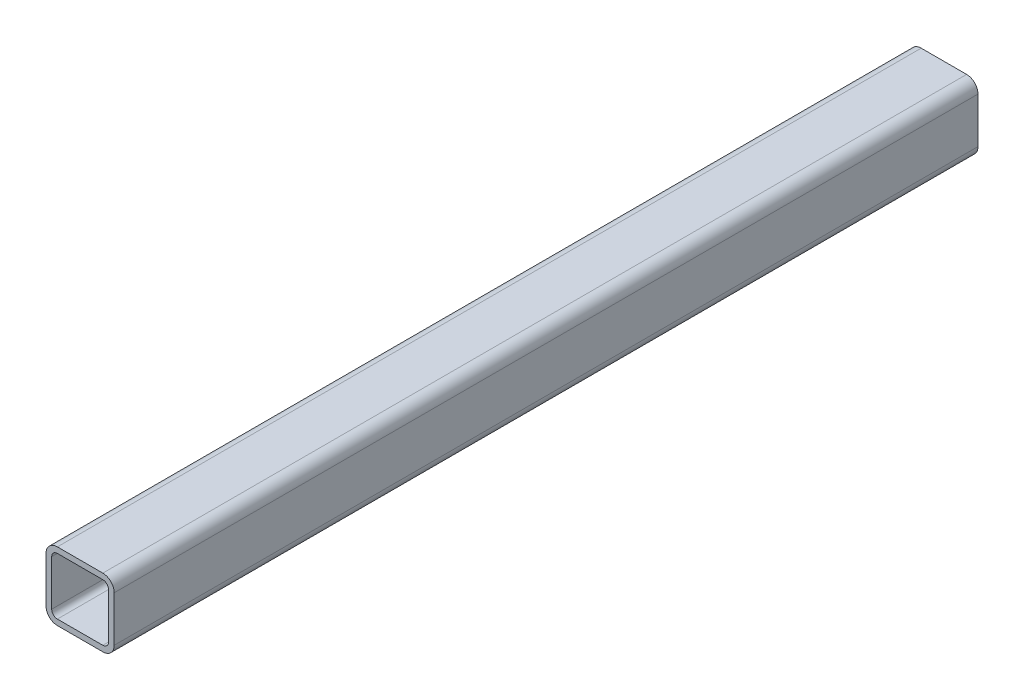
ISO-10303-21;
HEADER;
FILE_DESCRIPTION(('STEP AP214'),'2;1');
FILE_NAME('part.step','',(''),(''),'','','');
FILE_SCHEMA(('AUTOMOTIVE_DESIGN { 1 0 10303 214 1 1 1 1 }'));
ENDSEC;
DATA;
#1=APPLICATION_CONTEXT('core data for automotive mechanical design processes');
#2=APPLICATION_PROTOCOL_DEFINITION('international standard','automotive_design',2000,#1);
#3=PRODUCT_CONTEXT('',#1,'mechanical');
#4=PRODUCT('Part','Part','',(#3));
#5=PRODUCT_RELATED_PRODUCT_CATEGORY('part','',(#4));
#6=PRODUCT_DEFINITION_FORMATION('','',#4);
#7=PRODUCT_DEFINITION_CONTEXT('part definition',#1,'design');
#8=PRODUCT_DEFINITION('design','',#6,#7);
#9=PRODUCT_DEFINITION_SHAPE('','',#8);
#10=(LENGTH_UNIT() NAMED_UNIT(*) SI_UNIT(.MILLI.,.METRE.));
#11=(NAMED_UNIT(*) PLANE_ANGLE_UNIT() SI_UNIT($,.RADIAN.));
#12=(NAMED_UNIT(*) SI_UNIT($,.STERADIAN.) SOLID_ANGLE_UNIT());
#13=UNCERTAINTY_MEASURE_WITH_UNIT(LENGTH_MEASURE(1.E-05),#10,'distance_accuracy_value','');
#14=(GEOMETRIC_REPRESENTATION_CONTEXT(3) GLOBAL_UNCERTAINTY_ASSIGNED_CONTEXT((#13)) GLOBAL_UNIT_ASSIGNED_CONTEXT((#10,
#11,#12)) REPRESENTATION_CONTEXT('',''));
#15=CARTESIAN_POINT('',(0.,0.,0.));
#16=DIRECTION('',(0.,0.,1.));
#17=DIRECTION('',(1.,0.,0.));
#18=AXIS2_PLACEMENT_3D('',#15,#16,#17);
#19=CARTESIAN_POINT('',(20.,20.,760.));
#20=DIRECTION('',(0.,0.,1.));
#21=DIRECTION('',(1.,0.,0.));
#22=AXIS2_PLACEMENT_3D('',#19,#20,#21);
#23=PLANE('',#22);
#24=CARTESIAN_POINT('',(20.,20.,760.));
#25=DIRECTION('',(0.,0.,1.));
#26=DIRECTION('',(1.,0.,0.));
#27=AXIS2_PLACEMENT_3D('',#24,#25,#26);
#28=CIRCLE('',#27,10.);
#29=CARTESIAN_POINT('',(30.,20.,760.));
#30=VERTEX_POINT('',#29);
#31=CARTESIAN_POINT('',(20.,30.,760.));
#32=VERTEX_POINT('',#31);
#33=EDGE_CURVE('E210',#30,#32,#28,.T.);
#34=ORIENTED_EDGE('',*,*,#33,.T.);
#35=DIRECTION('',(-1.,0.,0.));
#36=VECTOR('',#35,1.);
#37=CARTESIAN_POINT('',(20.,30.,760.));
#38=LINE('',#37,#36);
#39=CARTESIAN_POINT('',(-20.,30.,760.));
#40=VERTEX_POINT('',#39);
#41=EDGE_CURVE('E213',#32,#40,#38,.T.);
#42=ORIENTED_EDGE('',*,*,#41,.T.);
#43=CARTESIAN_POINT('',(-20.,20.,760.));
#44=DIRECTION('',(0.,0.,1.));
#45=DIRECTION('',(1.,0.,0.));
#46=AXIS2_PLACEMENT_3D('',#43,#44,#45);
#47=CIRCLE('',#46,10.);
#48=CARTESIAN_POINT('',(-30.,20.,760.));
#49=VERTEX_POINT('',#48);
#50=EDGE_CURVE('E216',#40,#49,#47,.T.);
#51=ORIENTED_EDGE('',*,*,#50,.T.);
#52=DIRECTION('',(0.,-1.,0.));
#53=VECTOR('',#52,1.);
#54=CARTESIAN_POINT('',(-30.,-20.,760.));
#55=LINE('',#54,#53);
#56=CARTESIAN_POINT('',(-30.,-20.,760.));
#57=VERTEX_POINT('',#56);
#58=EDGE_CURVE('E218',#49,#57,#55,.T.);
#59=ORIENTED_EDGE('',*,*,#58,.T.);
#60=CARTESIAN_POINT('',(-20.,-20.,760.));
#61=DIRECTION('',(0.,0.,1.));
#62=DIRECTION('',(1.,0.,0.));
#63=AXIS2_PLACEMENT_3D('',#60,#61,#62);
#64=CIRCLE('',#63,10.);
#65=CARTESIAN_POINT('',(-20.,-30.,760.));
#66=VERTEX_POINT('',#65);
#67=EDGE_CURVE('E220',#57,#66,#64,.T.);
#68=ORIENTED_EDGE('',*,*,#67,.T.);
#69=DIRECTION('',(1.,0.,0.));
#70=VECTOR('',#69,1.);
#71=CARTESIAN_POINT('',(-20.,-30.,760.));
#72=LINE('',#71,#70);
#73=CARTESIAN_POINT('',(20.,-30.,760.));
#74=VERTEX_POINT('',#73);
#75=EDGE_CURVE('E222',#66,#74,#72,.T.);
#76=ORIENTED_EDGE('',*,*,#75,.T.);
#77=CARTESIAN_POINT('',(20.,-20.,760.));
#78=DIRECTION('',(0.,0.,1.));
#79=DIRECTION('',(1.,0.,0.));
#80=AXIS2_PLACEMENT_3D('',#77,#78,#79);
#81=CIRCLE('',#80,10.);
#82=CARTESIAN_POINT('',(30.,-20.,760.));
#83=VERTEX_POINT('',#82);
#84=EDGE_CURVE('E224',#74,#83,#81,.T.);
#85=ORIENTED_EDGE('',*,*,#84,.T.);
#86=DIRECTION('',(0.,1.,0.));
#87=VECTOR('',#86,1.);
#88=CARTESIAN_POINT('',(30.,20.,760.));
#89=LINE('',#88,#87);
#90=EDGE_CURVE('E226',#83,#30,#89,.T.);
#91=ORIENTED_EDGE('',*,*,#90,.T.);
#92=EDGE_LOOP('',(#34,#42,#51,#59,#68,#76,#85,#91));
#93=FACE_BOUND('',#92,.T.);
#94=DIRECTION('',(0.,-1.,0.));
#95=VECTOR('',#94,1.);
#96=CARTESIAN_POINT('',(-25.,-20.,760.));
#97=LINE('',#96,#95);
#98=CARTESIAN_POINT('',(-25.,20.,760.));
#99=VERTEX_POINT('',#98);
#100=CARTESIAN_POINT('',(-25.,-20.,760.));
#101=VERTEX_POINT('',#100);
#102=EDGE_CURVE('E153',#99,#101,#97,.T.);
#103=ORIENTED_EDGE('',*,*,#102,.F.);
#104=CARTESIAN_POINT('',(-20.,20.,760.));
#105=DIRECTION('',(0.,0.,1.));
#106=DIRECTION('',(1.,0.,0.));
#107=AXIS2_PLACEMENT_3D('',#104,#105,#106);
#108=CIRCLE('',#107,5.00000000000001);
#109=CARTESIAN_POINT('',(-20.,25.,760.));
#110=VERTEX_POINT('',#109);
#111=EDGE_CURVE('E145',#110,#99,#108,.T.);
#112=ORIENTED_EDGE('',*,*,#111,.F.);
#113=DIRECTION('',(-1.,0.,0.));
#114=VECTOR('',#113,1.);
#115=CARTESIAN_POINT('',(20.,25.,760.));
#116=LINE('',#115,#114);
#117=CARTESIAN_POINT('',(20.,25.,760.));
#118=VERTEX_POINT('',#117);
#119=EDGE_CURVE('E178',#118,#110,#116,.T.);
#120=ORIENTED_EDGE('',*,*,#119,.F.);
#121=CARTESIAN_POINT('',(20.,20.,760.));
#122=DIRECTION('',(0.,0.,1.));
#123=DIRECTION('',(1.,0.,0.));
#124=AXIS2_PLACEMENT_3D('',#121,#122,#123);
#125=CIRCLE('',#124,5.00000000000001);
#126=CARTESIAN_POINT('',(25.,20.,760.));
#127=VERTEX_POINT('',#126);
#128=EDGE_CURVE('E176',#127,#118,#125,.T.);
#129=ORIENTED_EDGE('',*,*,#128,.F.);
#130=DIRECTION('',(0.,1.,0.));
#131=VECTOR('',#130,1.);
#132=CARTESIAN_POINT('',(25.,20.,760.));
#133=LINE('',#132,#131);
#134=CARTESIAN_POINT('',(25.,-20.,760.));
#135=VERTEX_POINT('',#134);
#136=EDGE_CURVE('E174',#135,#127,#133,.T.);
#137=ORIENTED_EDGE('',*,*,#136,.F.);
#138=CARTESIAN_POINT('',(20.,-20.,760.));
#139=DIRECTION('',(0.,0.,1.));
#140=DIRECTION('',(1.,0.,0.));
#141=AXIS2_PLACEMENT_3D('',#138,#139,#140);
#142=CIRCLE('',#141,5.00000000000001);
#143=CARTESIAN_POINT('',(20.,-25.,760.));
#144=VERTEX_POINT('',#143);
#145=EDGE_CURVE('E172',#144,#135,#142,.T.);
#146=ORIENTED_EDGE('',*,*,#145,.F.);
#147=DIRECTION('',(1.,0.,0.));
#148=VECTOR('',#147,1.);
#149=CARTESIAN_POINT('',(-20.,-25.,760.));
#150=LINE('',#149,#148);
#151=CARTESIAN_POINT('',(-20.,-25.,760.));
#152=VERTEX_POINT('',#151);
#153=EDGE_CURVE('E168',#152,#144,#150,.T.);
#154=ORIENTED_EDGE('',*,*,#153,.F.);
#155=CARTESIAN_POINT('',(-20.,-20.,760.));
#156=DIRECTION('',(0.,0.,1.));
#157=DIRECTION('',(1.,0.,0.));
#158=AXIS2_PLACEMENT_3D('',#155,#156,#157);
#159=CIRCLE('',#158,5.);
#160=EDGE_CURVE('E166',#101,#152,#159,.T.);
#161=ORIENTED_EDGE('',*,*,#160,.F.);
#162=EDGE_LOOP('',(#103,#112,#120,#129,#137,#146,#154,#161));
#163=FACE_BOUND('',#162,.T.);
#164=ADVANCED_FACE('F32',(#93,#163),#23,.T.);
#165=CARTESIAN_POINT('',(20.,20.,0.));
#166=DIRECTION('',(0.,0.,1.));
#167=DIRECTION('',(1.,0.,0.));
#168=AXIS2_PLACEMENT_3D('',#165,#166,#167);
#169=PLANE('',#168);
#170=CARTESIAN_POINT('',(20.,20.,0.));
#171=DIRECTION('',(0.,0.,1.));
#172=DIRECTION('',(1.,0.,0.));
#173=AXIS2_PLACEMENT_3D('',#170,#171,#172);
#174=CIRCLE('',#173,10.);
#175=CARTESIAN_POINT('',(30.,20.,0.));
#176=VERTEX_POINT('',#175);
#177=CARTESIAN_POINT('',(20.,30.,0.));
#178=VERTEX_POINT('',#177);
#179=EDGE_CURVE('E161',#176,#178,#174,.T.);
#180=ORIENTED_EDGE('',*,*,#179,.F.);
#181=DIRECTION('',(0.,1.,0.));
#182=VECTOR('',#181,1.);
#183=CARTESIAN_POINT('',(30.,20.,0.));
#184=LINE('',#183,#182);
#185=CARTESIAN_POINT('',(30.,-20.,0.));
#186=VERTEX_POINT('',#185);
#187=EDGE_CURVE('E214',#186,#176,#184,.T.);
#188=ORIENTED_EDGE('',*,*,#187,.F.);
#189=CARTESIAN_POINT('',(20.,-20.,0.));
#190=DIRECTION('',(0.,0.,1.));
#191=DIRECTION('',(1.,0.,0.));
#192=AXIS2_PLACEMENT_3D('',#189,#190,#191);
#193=CIRCLE('',#192,10.);
#194=CARTESIAN_POINT('',(20.,-30.,0.));
#195=VERTEX_POINT('',#194);
#196=EDGE_CURVE('E241',#195,#186,#193,.T.);
#197=ORIENTED_EDGE('',*,*,#196,.F.);
#198=DIRECTION('',(1.,0.,0.));
#199=VECTOR('',#198,1.);
#200=CARTESIAN_POINT('',(-20.,-30.,0.));
#201=LINE('',#200,#199);
#202=CARTESIAN_POINT('',(-20.,-30.,0.));
#203=VERTEX_POINT('',#202);
#204=EDGE_CURVE('E239',#203,#195,#201,.T.);
#205=ORIENTED_EDGE('',*,*,#204,.F.);
#206=CARTESIAN_POINT('',(-20.,-20.,0.));
#207=DIRECTION('',(0.,0.,1.));
#208=DIRECTION('',(1.,0.,0.));
#209=AXIS2_PLACEMENT_3D('',#206,#207,#208);
#210=CIRCLE('',#209,10.);
#211=CARTESIAN_POINT('',(-30.,-20.,0.));
#212=VERTEX_POINT('',#211);
#213=EDGE_CURVE('E237',#212,#203,#210,.T.);
#214=ORIENTED_EDGE('',*,*,#213,.F.);
#215=DIRECTION('',(0.,-1.,0.));
#216=VECTOR('',#215,1.);
#217=CARTESIAN_POINT('',(-30.,-20.,0.));
#218=LINE('',#217,#216);
#219=CARTESIAN_POINT('',(-30.,20.,0.));
#220=VERTEX_POINT('',#219);
#221=EDGE_CURVE('E235',#220,#212,#218,.T.);
#222=ORIENTED_EDGE('',*,*,#221,.F.);
#223=CARTESIAN_POINT('',(-20.,20.,0.));
#224=DIRECTION('',(0.,0.,1.));
#225=DIRECTION('',(1.,0.,0.));
#226=AXIS2_PLACEMENT_3D('',#223,#224,#225);
#227=CIRCLE('',#226,10.);
#228=CARTESIAN_POINT('',(-20.,30.,0.));
#229=VERTEX_POINT('',#228);
#230=EDGE_CURVE('E233',#229,#220,#227,.T.);
#231=ORIENTED_EDGE('',*,*,#230,.F.);
#232=DIRECTION('',(-1.,0.,0.));
#233=VECTOR('',#232,1.);
#234=CARTESIAN_POINT('',(20.,30.,0.));
#235=LINE('',#234,#233);
#236=EDGE_CURVE('E231',#178,#229,#235,.T.);
#237=ORIENTED_EDGE('',*,*,#236,.F.);
#238=EDGE_LOOP('',(#180,#188,#197,#205,#214,#222,#231,#237));
#239=FACE_BOUND('',#238,.T.);
#240=CARTESIAN_POINT('',(-20.,20.,0.));
#241=DIRECTION('',(0.,0.,1.));
#242=DIRECTION('',(1.,0.,0.));
#243=AXIS2_PLACEMENT_3D('',#240,#241,#242);
#244=CIRCLE('',#243,5.00000000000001);
#245=CARTESIAN_POINT('',(-20.,25.,0.));
#246=VERTEX_POINT('',#245);
#247=CARTESIAN_POINT('',(-25.,20.,0.));
#248=VERTEX_POINT('',#247);
#249=EDGE_CURVE('E55',#246,#248,#244,.T.);
#250=ORIENTED_EDGE('',*,*,#249,.T.);
#251=DIRECTION('',(0.,-1.,0.));
#252=VECTOR('',#251,1.);
#253=CARTESIAN_POINT('',(-25.,-20.,0.));
#254=LINE('',#253,#252);
#255=CARTESIAN_POINT('',(-25.,-20.,0.));
#256=VERTEX_POINT('',#255);
#257=EDGE_CURVE('E160',#248,#256,#254,.T.);
#258=ORIENTED_EDGE('',*,*,#257,.T.);
#259=CARTESIAN_POINT('',(-20.,-20.,0.));
#260=DIRECTION('',(0.,0.,1.));
#261=DIRECTION('',(1.,0.,0.));
#262=AXIS2_PLACEMENT_3D('',#259,#260,#261);
#263=CIRCLE('',#262,5.);
#264=CARTESIAN_POINT('',(-20.,-25.,0.));
#265=VERTEX_POINT('',#264);
#266=EDGE_CURVE('E182',#256,#265,#263,.T.);
#267=ORIENTED_EDGE('',*,*,#266,.T.);
#268=DIRECTION('',(1.,0.,0.));
#269=VECTOR('',#268,1.);
#270=CARTESIAN_POINT('',(-20.,-25.,0.));
#271=LINE('',#270,#269);
#272=CARTESIAN_POINT('',(20.,-25.,0.));
#273=VERTEX_POINT('',#272);
#274=EDGE_CURVE('E185',#265,#273,#271,.T.);
#275=ORIENTED_EDGE('',*,*,#274,.T.);
#276=CARTESIAN_POINT('',(20.,-20.,0.));
#277=DIRECTION('',(0.,0.,1.));
#278=DIRECTION('',(1.,0.,0.));
#279=AXIS2_PLACEMENT_3D('',#276,#277,#278);
#280=CIRCLE('',#279,5.00000000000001);
#281=CARTESIAN_POINT('',(25.,-20.,0.));
#282=VERTEX_POINT('',#281);
#283=EDGE_CURVE('E188',#273,#282,#280,.T.);
#284=ORIENTED_EDGE('',*,*,#283,.T.);
#285=DIRECTION('',(0.,1.,0.));
#286=VECTOR('',#285,1.);
#287=CARTESIAN_POINT('',(25.,20.,0.));
#288=LINE('',#287,#286);
#289=CARTESIAN_POINT('',(25.,20.,0.));
#290=VERTEX_POINT('',#289);
#291=EDGE_CURVE('E191',#282,#290,#288,.T.);
#292=ORIENTED_EDGE('',*,*,#291,.T.);
#293=CARTESIAN_POINT('',(20.,20.,0.));
#294=DIRECTION('',(0.,0.,1.));
#295=DIRECTION('',(1.,0.,0.));
#296=AXIS2_PLACEMENT_3D('',#293,#294,#295);
#297=CIRCLE('',#296,5.00000000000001);
#298=CARTESIAN_POINT('',(20.,25.,0.));
#299=VERTEX_POINT('',#298);
#300=EDGE_CURVE('E194',#290,#299,#297,.T.);
#301=ORIENTED_EDGE('',*,*,#300,.T.);
#302=DIRECTION('',(-1.,0.,0.));
#303=VECTOR('',#302,1.);
#304=CARTESIAN_POINT('',(20.,25.,0.));
#305=LINE('',#304,#303);
#306=EDGE_CURVE('E154',#299,#246,#305,.T.);
#307=ORIENTED_EDGE('',*,*,#306,.T.);
#308=EDGE_LOOP('',(#250,#258,#267,#275,#284,#292,#301,#307));
#309=FACE_BOUND('',#308,.T.);
#310=ADVANCED_FACE('F271',(#239,#309),#169,.F.);
#311=CARTESIAN_POINT('',(20.,20.,760.));
#312=DIRECTION('',(0.,0.,-1.));
#313=DIRECTION('',(-1.,0.,0.));
#314=AXIS2_PLACEMENT_3D('',#311,#312,#313);
#315=CYLINDRICAL_SURFACE('',#314,10.);
#316=ORIENTED_EDGE('',*,*,#179,.T.);
#317=DIRECTION('',(0.,0.,-1.));
#318=VECTOR('',#317,1.);
#319=CARTESIAN_POINT('',(20.,30.,760.));
#320=LINE('',#319,#318);
#321=EDGE_CURVE('E11',#32,#178,#320,.T.);
#322=ORIENTED_EDGE('',*,*,#321,.F.);
#323=ORIENTED_EDGE('',*,*,#33,.F.);
#324=DIRECTION('',(0.,0.,-1.));
#325=VECTOR('',#324,1.);
#326=CARTESIAN_POINT('',(30.,20.,760.));
#327=LINE('',#326,#325);
#328=EDGE_CURVE('E228',#30,#176,#327,.T.);
#329=ORIENTED_EDGE('',*,*,#328,.T.);
#330=EDGE_LOOP('',(#316,#322,#323,#329));
#331=FACE_BOUND('',#330,.T.);
#332=ADVANCED_FACE('F34',(#331),#315,.T.);
#333=CARTESIAN_POINT('',(20.,30.,760.));
#334=DIRECTION('',(0.,-1.,0.));
#335=DIRECTION('',(1.,0.,0.));
#336=AXIS2_PLACEMENT_3D('',#333,#334,#335);
#337=PLANE('',#336);
#338=ORIENTED_EDGE('',*,*,#236,.T.);
#339=DIRECTION('',(0.,0.,-1.));
#340=VECTOR('',#339,1.);
#341=CARTESIAN_POINT('',(-20.,30.,760.));
#342=LINE('',#341,#340);
#343=EDGE_CURVE('E40',#40,#229,#342,.T.);
#344=ORIENTED_EDGE('',*,*,#343,.F.);
#345=ORIENTED_EDGE('',*,*,#41,.F.);
#346=ORIENTED_EDGE('',*,*,#321,.T.);
#347=EDGE_LOOP('',(#338,#344,#345,#346));
#348=FACE_BOUND('',#347,.T.);
#349=ADVANCED_FACE('F288',(#348),#337,.F.);
#350=CARTESIAN_POINT('',(-20.,20.,760.));
#351=DIRECTION('',(0.,0.,-1.));
#352=DIRECTION('',(-1.,0.,0.));
#353=AXIS2_PLACEMENT_3D('',#350,#351,#352);
#354=CYLINDRICAL_SURFACE('',#353,10.);
#355=ORIENTED_EDGE('',*,*,#230,.T.);
#356=DIRECTION('',(0.,0.,-1.));
#357=VECTOR('',#356,1.);
#358=CARTESIAN_POINT('',(-30.,20.,760.));
#359=LINE('',#358,#357);
#360=EDGE_CURVE('E258',#49,#220,#359,.T.);
#361=ORIENTED_EDGE('',*,*,#360,.F.);
#362=ORIENTED_EDGE('',*,*,#50,.F.);
#363=ORIENTED_EDGE('',*,*,#343,.T.);
#364=EDGE_LOOP('',(#355,#361,#362,#363));
#365=FACE_BOUND('',#364,.T.);
#366=ADVANCED_FACE('F265',(#365),#354,.T.);
#367=CARTESIAN_POINT('',(-30.,-20.,760.));
#368=DIRECTION('',(1.,0.,0.));
#369=DIRECTION('',(0.,1.,0.));
#370=AXIS2_PLACEMENT_3D('',#367,#368,#369);
#371=PLANE('',#370);
#372=ORIENTED_EDGE('',*,*,#221,.T.);
#373=DIRECTION('',(0.,0.,-1.));
#374=VECTOR('',#373,1.);
#375=CARTESIAN_POINT('',(-30.,-20.,760.));
#376=LINE('',#375,#374);
#377=EDGE_CURVE('E255',#57,#212,#376,.T.);
#378=ORIENTED_EDGE('',*,*,#377,.F.);
#379=ORIENTED_EDGE('',*,*,#58,.F.);
#380=ORIENTED_EDGE('',*,*,#360,.T.);
#381=EDGE_LOOP('',(#372,#378,#379,#380));
#382=FACE_BOUND('',#381,.T.);
#383=ADVANCED_FACE('F277',(#382),#371,.F.);
#384=CARTESIAN_POINT('',(-20.,-20.,760.));
#385=DIRECTION('',(0.,0.,-1.));
#386=DIRECTION('',(-1.,0.,0.));
#387=AXIS2_PLACEMENT_3D('',#384,#385,#386);
#388=CYLINDRICAL_SURFACE('',#387,10.);
#389=ORIENTED_EDGE('',*,*,#213,.T.);
#390=DIRECTION('',(0.,0.,-1.));
#391=VECTOR('',#390,1.);
#392=CARTESIAN_POINT('',(-20.,-30.,760.));
#393=LINE('',#392,#391);
#394=EDGE_CURVE('E252',#66,#203,#393,.T.);
#395=ORIENTED_EDGE('',*,*,#394,.F.);
#396=ORIENTED_EDGE('',*,*,#67,.F.);
#397=ORIENTED_EDGE('',*,*,#377,.T.);
#398=EDGE_LOOP('',(#389,#395,#396,#397));
#399=FACE_BOUND('',#398,.T.);
#400=ADVANCED_FACE('F281',(#399),#388,.T.);
#401=CARTESIAN_POINT('',(-20.,-30.,760.));
#402=DIRECTION('',(0.,1.,0.));
#403=DIRECTION('',(-1.,0.,0.));
#404=AXIS2_PLACEMENT_3D('',#401,#402,#403);
#405=PLANE('',#404);
#406=ORIENTED_EDGE('',*,*,#204,.T.);
#407=DIRECTION('',(0.,0.,-1.));
#408=VECTOR('',#407,1.);
#409=CARTESIAN_POINT('',(20.,-30.,760.));
#410=LINE('',#409,#408);
#411=EDGE_CURVE('E249',#74,#195,#410,.T.);
#412=ORIENTED_EDGE('',*,*,#411,.F.);
#413=ORIENTED_EDGE('',*,*,#75,.F.);
#414=ORIENTED_EDGE('',*,*,#394,.T.);
#415=EDGE_LOOP('',(#406,#412,#413,#414));
#416=FACE_BOUND('',#415,.T.);
#417=ADVANCED_FACE('F301',(#416),#405,.F.);
#418=CARTESIAN_POINT('',(20.,-20.,760.));
#419=DIRECTION('',(0.,0.,-1.));
#420=DIRECTION('',(-1.,0.,0.));
#421=AXIS2_PLACEMENT_3D('',#418,#419,#420);
#422=CYLINDRICAL_SURFACE('',#421,10.);
#423=ORIENTED_EDGE('',*,*,#196,.T.);
#424=DIRECTION('',(0.,0.,-1.));
#425=VECTOR('',#424,1.);
#426=CARTESIAN_POINT('',(30.,-20.,760.));
#427=LINE('',#426,#425);
#428=EDGE_CURVE('E246',#83,#186,#427,.T.);
#429=ORIENTED_EDGE('',*,*,#428,.F.);
#430=ORIENTED_EDGE('',*,*,#84,.F.);
#431=ORIENTED_EDGE('',*,*,#411,.T.);
#432=EDGE_LOOP('',(#423,#429,#430,#431));
#433=FACE_BOUND('',#432,.T.);
#434=ADVANCED_FACE('F299',(#433),#422,.T.);
#435=CARTESIAN_POINT('',(30.,20.,760.));
#436=DIRECTION('',(-1.,0.,0.));
#437=DIRECTION('',(0.,0.,1.));
#438=AXIS2_PLACEMENT_3D('',#435,#436,#437);
#439=PLANE('',#438);
#440=ORIENTED_EDGE('',*,*,#187,.T.);
#441=ORIENTED_EDGE('',*,*,#328,.F.);
#442=ORIENTED_EDGE('',*,*,#90,.F.);
#443=ORIENTED_EDGE('',*,*,#428,.T.);
#444=EDGE_LOOP('',(#440,#441,#442,#443));
#445=FACE_BOUND('',#444,.T.);
#446=ADVANCED_FACE('F294',(#445),#439,.F.);
#447=CARTESIAN_POINT('',(-20.,20.,760.));
#448=DIRECTION('',(0.,0.,-1.));
#449=DIRECTION('',(-1.,0.,0.));
#450=AXIS2_PLACEMENT_3D('',#447,#448,#449);
#451=CYLINDRICAL_SURFACE('',#450,5.00000000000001);
#452=ORIENTED_EDGE('',*,*,#249,.F.);
#453=DIRECTION('',(0.,0.,-1.));
#454=VECTOR('',#453,1.);
#455=CARTESIAN_POINT('',(-20.,25.,760.));
#456=LINE('',#455,#454);
#457=EDGE_CURVE('E149',#110,#246,#456,.T.);
#458=ORIENTED_EDGE('',*,*,#457,.F.);
#459=ORIENTED_EDGE('',*,*,#111,.T.);
#460=DIRECTION('',(0.,0.,-1.));
#461=VECTOR('',#460,1.);
#462=CARTESIAN_POINT('',(-25.,20.,760.));
#463=LINE('',#462,#461);
#464=EDGE_CURVE('E148',#99,#248,#463,.T.);
#465=ORIENTED_EDGE('',*,*,#464,.T.);
#466=EDGE_LOOP('',(#452,#458,#459,#465));
#467=FACE_BOUND('',#466,.T.);
#468=ADVANCED_FACE('F147',(#467),#451,.F.);
#469=CARTESIAN_POINT('',(-25.,-20.,760.));
#470=DIRECTION('',(1.,0.,0.));
#471=DIRECTION('',(0.,1.,0.));
#472=AXIS2_PLACEMENT_3D('',#469,#470,#471);
#473=PLANE('',#472);
#474=ORIENTED_EDGE('',*,*,#257,.F.);
#475=ORIENTED_EDGE('',*,*,#464,.F.);
#476=ORIENTED_EDGE('',*,*,#102,.T.);
#477=DIRECTION('',(0.,0.,-1.));
#478=VECTOR('',#477,1.);
#479=CARTESIAN_POINT('',(-25.,-20.,760.));
#480=LINE('',#479,#478);
#481=EDGE_CURVE('E162',#101,#256,#480,.T.);
#482=ORIENTED_EDGE('',*,*,#481,.T.);
#483=EDGE_LOOP('',(#474,#475,#476,#482));
#484=FACE_BOUND('',#483,.T.);
#485=ADVANCED_FACE('F157',(#484),#473,.T.);
#486=CARTESIAN_POINT('',(-20.,-20.,760.));
#487=DIRECTION('',(0.,0.,-1.));
#488=DIRECTION('',(-1.,0.,0.));
#489=AXIS2_PLACEMENT_3D('',#486,#487,#488);
#490=CYLINDRICAL_SURFACE('',#489,5.);
#491=ORIENTED_EDGE('',*,*,#266,.F.);
#492=ORIENTED_EDGE('',*,*,#481,.F.);
#493=ORIENTED_EDGE('',*,*,#160,.T.);
#494=DIRECTION('',(0.,0.,-1.));
#495=VECTOR('',#494,1.);
#496=CARTESIAN_POINT('',(-20.,-25.,760.));
#497=LINE('',#496,#495);
#498=EDGE_CURVE('E207',#152,#265,#497,.T.);
#499=ORIENTED_EDGE('',*,*,#498,.T.);
#500=EDGE_LOOP('',(#491,#492,#493,#499));
#501=FACE_BOUND('',#500,.T.);
#502=ADVANCED_FACE('F326',(#501),#490,.F.);
#503=CARTESIAN_POINT('',(-20.,-25.,760.));
#504=DIRECTION('',(0.,1.,0.));
#505=DIRECTION('',(-1.,0.,0.));
#506=AXIS2_PLACEMENT_3D('',#503,#504,#505);
#507=PLANE('',#506);
#508=ORIENTED_EDGE('',*,*,#274,.F.);
#509=ORIENTED_EDGE('',*,*,#498,.F.);
#510=ORIENTED_EDGE('',*,*,#153,.T.);
#511=DIRECTION('',(0.,0.,-1.));
#512=VECTOR('',#511,1.);
#513=CARTESIAN_POINT('',(20.,-25.,760.));
#514=LINE('',#513,#512);
#515=EDGE_CURVE('E205',#144,#273,#514,.T.);
#516=ORIENTED_EDGE('',*,*,#515,.T.);
#517=EDGE_LOOP('',(#508,#509,#510,#516));
#518=FACE_BOUND('',#517,.T.);
#519=ADVANCED_FACE('F330',(#518),#507,.T.);
#520=CARTESIAN_POINT('',(20.,-20.,760.));
#521=DIRECTION('',(0.,0.,-1.));
#522=DIRECTION('',(-1.,0.,0.));
#523=AXIS2_PLACEMENT_3D('',#520,#521,#522);
#524=CYLINDRICAL_SURFACE('',#523,5.00000000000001);
#525=ORIENTED_EDGE('',*,*,#283,.F.);
#526=ORIENTED_EDGE('',*,*,#515,.F.);
#527=ORIENTED_EDGE('',*,*,#145,.T.);
#528=DIRECTION('',(0.,0.,-1.));
#529=VECTOR('',#528,1.);
#530=CARTESIAN_POINT('',(25.,-20.,760.));
#531=LINE('',#530,#529);
#532=EDGE_CURVE('E203',#135,#282,#531,.T.);
#533=ORIENTED_EDGE('',*,*,#532,.T.);
#534=EDGE_LOOP('',(#525,#526,#527,#533));
#535=FACE_BOUND('',#534,.T.);
#536=ADVANCED_FACE('F336',(#535),#524,.F.);
#537=CARTESIAN_POINT('',(25.,20.,760.));
#538=DIRECTION('',(-1.,0.,0.));
#539=DIRECTION('',(0.,0.,1.));
#540=AXIS2_PLACEMENT_3D('',#537,#538,#539);
#541=PLANE('',#540);
#542=ORIENTED_EDGE('',*,*,#291,.F.);
#543=ORIENTED_EDGE('',*,*,#532,.F.);
#544=ORIENTED_EDGE('',*,*,#136,.T.);
#545=DIRECTION('',(0.,0.,-1.));
#546=VECTOR('',#545,1.);
#547=CARTESIAN_POINT('',(25.,20.,760.));
#548=LINE('',#547,#546);
#549=EDGE_CURVE('E201',#127,#290,#548,.T.);
#550=ORIENTED_EDGE('',*,*,#549,.T.);
#551=EDGE_LOOP('',(#542,#543,#544,#550));
#552=FACE_BOUND('',#551,.T.);
#553=ADVANCED_FACE('F340',(#552),#541,.T.);
#554=CARTESIAN_POINT('',(20.,20.,760.));
#555=DIRECTION('',(0.,0.,-1.));
#556=DIRECTION('',(-1.,0.,0.));
#557=AXIS2_PLACEMENT_3D('',#554,#555,#556);
#558=CYLINDRICAL_SURFACE('',#557,5.00000000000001);
#559=ORIENTED_EDGE('',*,*,#300,.F.);
#560=ORIENTED_EDGE('',*,*,#549,.F.);
#561=ORIENTED_EDGE('',*,*,#128,.T.);
#562=DIRECTION('',(0.,0.,-1.));
#563=VECTOR('',#562,1.);
#564=CARTESIAN_POINT('',(20.,25.,760.));
#565=LINE('',#564,#563);
#566=EDGE_CURVE('E47',#118,#299,#565,.T.);
#567=ORIENTED_EDGE('',*,*,#566,.T.);
#568=EDGE_LOOP('',(#559,#560,#561,#567));
#569=FACE_BOUND('',#568,.T.);
#570=ADVANCED_FACE('F344',(#569),#558,.F.);
#571=CARTESIAN_POINT('',(20.,25.,760.));
#572=DIRECTION('',(0.,-1.,0.));
#573=DIRECTION('',(1.,0.,0.));
#574=AXIS2_PLACEMENT_3D('',#571,#572,#573);
#575=PLANE('',#574);
#576=ORIENTED_EDGE('',*,*,#306,.F.);
#577=ORIENTED_EDGE('',*,*,#566,.F.);
#578=ORIENTED_EDGE('',*,*,#119,.T.);
#579=ORIENTED_EDGE('',*,*,#457,.T.);
#580=EDGE_LOOP('',(#576,#577,#578,#579));
#581=FACE_BOUND('',#580,.T.);
#582=ADVANCED_FACE('F348',(#581),#575,.T.);
#583=CLOSED_SHELL('',(#164,#310,#332,#349,#366,#383,#400,#417,#434,#446,#468,#485,#502,#519,
#536,#553,#570,#582));
#584=MANIFOLD_SOLID_BREP('B2',#583);
#585=ADVANCED_BREP_SHAPE_REPRESENTATION('',(#18,#584),#14);
#586=SHAPE_DEFINITION_REPRESENTATION(#9,#585);
ENDSEC;
END-ISO-10303-21;
